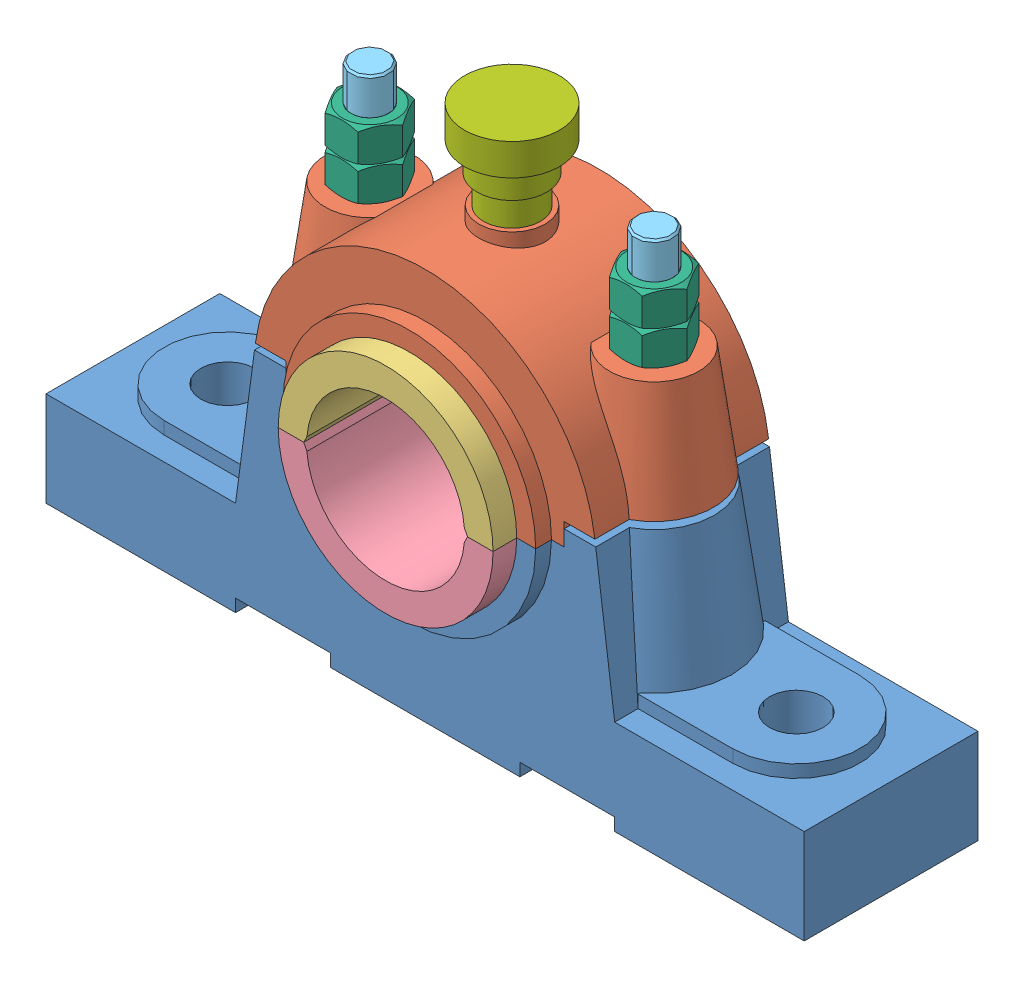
SolidWorks assembly 滑动轴承座.SLDASM, configuration 默认 (file format 3400). Lengths in mm.
Overall size (240 156 80).
11 component instances, 7 part files, 32 mates.
Components (placement in the parent):
- 轴承座-1: 轴承座.SLDPRT [默认] at origin size (240 75 65)
- 轴承盖-1: 轴承盖.SLDPRT [默认] at origin size (127.64 58 65)
- 上轴衬-1: 上轴衬.SLDPRT [默认] at origin size (68 34 80)
- 下轴衬-1: 下轴衬.SLDPRT [默认] at origin size (68 34 80)
- 螺栓-1: 螺栓.SLDPRT [GB_FASTENER_BOLT_HHBFTC M12X120-N] at (45 7.5 0) x (0 1 0) z (0.335776 0 0.941942) size (137.5 20.78 18)
- 螺栓-2: 螺栓.SLDPRT [GB_FASTENER_BOLT_HHBFTC M12X120-N] at (-45 7.5 0) x (0 1 0) z (0.95726 0 -0.289228) size (137.5 20.78 18)
- 螺母-1: 螺母.SLDPRT [GB_FASTENER_NUT_SNAB1 M12-N] at (-45 122.8 0) x (1 0 0) z (0 1 0) size (20.78 18 10.8)
- 螺母-2: 螺母.SLDPRT [GB_FASTENER_NUT_SNAB1 M12-N] at (-45 133.6 0) x (1 0 0) z (0 1 0) size (20.78 18 10.8)
- 螺母-3: 螺母.SLDPRT [GB_FASTENER_NUT_SNAB1 M12-N] at (45 122.8 0) x (1 0 0) z (0 1 0) size (20.78 18 10.8)
- 螺母-4: 螺母.SLDPRT [GB_FASTENER_NUT_SNAB1 M12-N] at (45 133.6 0) x (1 0 0) z (0 1 0) size (20.78 18 10.8)
- 油杯-1: 油杯.SLDPRT [默认] at origin size (30 58 30)
Mates (geometry in assembly coordinates):
- 重合4: coincident: point of ?
- 在位1: in place: plane of ?
- 重合5: coincident aligned: plane of ?; plane of assembly
- 重合6: coincident aligned: plane of ?; moOrthogonalPlaneRef_w of assembly
- 重合7: coincident anti-aligned: plane of ?; moOrthogonalPlaneRef_w of assembly
- 在位2: in place: unknown of ?
- 重合8: coincident aligned: plane of ?; plane of assembly
- 重合9: coincident aligned: plane of ?; moOrthogonalPlaneRef_w of assembly
- 重合10: coincident anti-aligned: plane of ?; moOrthogonalPlaneRef_w of assembly
- 在位3: in place: unknown of ?
- 重合5: coincident aligned: plane of ?; plane of assembly
- 重合6: coincident aligned: plane of ?; moOrthogonalPlaneRef_w of assembly
- 重合7: coincident anti-aligned: plane of ?; moOrthogonalPlaneRef_w of assembly
- 同心1: concentric anti-aligned: cylinder of ?
- 重合5: coincident anti-aligned: unknown of ?
- 同心2: concentric anti-aligned: unknown of ?
- 重合6: coincident anti-aligned: unknown of ?
- 同心3: concentric anti-aligned: cylinder of ?; cylinder of ?
- 重合7: coincident anti-aligned: unknown of ?
- 同心4: concentric anti-aligned: cylinder of ?; cylinder of ?
- 重合8: coincident anti-aligned: plane of ?; plane of ?
- 重合9: coincident aligned: line of ?; line of ?
- 同心5: concentric anti-aligned: cylinder of ?; cylinder of ?
- 同心7: concentric aligned: cylinder of ?; circle of ?
- 重合11: coincident anti-aligned: plane of ?; plane of ?
- 重合12: coincident aligned: line of ?; line of ?
- 重合13: coincident aligned: plane of ?; plane of ?
- 平行1: parallel aligned: unknown of ?
- 在位4: in place: unknown of ?
- 重合14: coincident aligned: plane of ?; plane of assembly
- 重合15: coincident aligned: plane of ?; moOrthogonalPlaneRef_w of assembly
- 重合16: coincident anti-aligned: plane of ?; moOrthogonalPlaneRef_w of assembly
